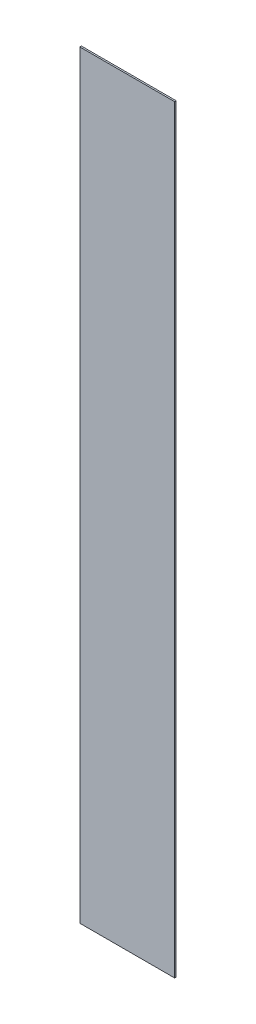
ISO-10303-21;
HEADER;
FILE_DESCRIPTION(('STEP AP214'),'2;1');
FILE_NAME('part.step','',(''),(''),'','','');
FILE_SCHEMA(('AUTOMOTIVE_DESIGN { 1 0 10303 214 1 1 1 1 }'));
ENDSEC;
DATA;
#1=APPLICATION_CONTEXT('core data for automotive mechanical design processes');
#2=APPLICATION_PROTOCOL_DEFINITION('international standard','automotive_design',2000,#1);
#3=PRODUCT_CONTEXT('',#1,'mechanical');
#4=PRODUCT('Part','Part','',(#3));
#5=PRODUCT_RELATED_PRODUCT_CATEGORY('part','',(#4));
#6=PRODUCT_DEFINITION_FORMATION('','',#4);
#7=PRODUCT_DEFINITION_CONTEXT('part definition',#1,'design');
#8=PRODUCT_DEFINITION('design','',#6,#7);
#9=PRODUCT_DEFINITION_SHAPE('','',#8);
#10=(LENGTH_UNIT() NAMED_UNIT(*) SI_UNIT(.MILLI.,.METRE.));
#11=(NAMED_UNIT(*) PLANE_ANGLE_UNIT() SI_UNIT($,.RADIAN.));
#12=(NAMED_UNIT(*) SI_UNIT($,.STERADIAN.) SOLID_ANGLE_UNIT());
#13=UNCERTAINTY_MEASURE_WITH_UNIT(LENGTH_MEASURE(1.E-05),#10,'distance_accuracy_value','');
#14=(GEOMETRIC_REPRESENTATION_CONTEXT(3) GLOBAL_UNCERTAINTY_ASSIGNED_CONTEXT((#13)) GLOBAL_UNIT_ASSIGNED_CONTEXT((#10,
#11,#12)) REPRESENTATION_CONTEXT('',''));
#15=CARTESIAN_POINT('',(0.,0.,0.));
#16=DIRECTION('',(0.,0.,1.));
#17=DIRECTION('',(1.,0.,0.));
#18=AXIS2_PLACEMENT_3D('',#15,#16,#17);
#19=CARTESIAN_POINT('',(-30.,480.,1.00000000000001));
#20=DIRECTION('',(1.,0.,0.));
#21=DIRECTION('',(0.,0.,-1.));
#22=AXIS2_PLACEMENT_3D('',#19,#20,#21);
#23=PLANE('',#22);
#24=DIRECTION('',(0.,0.,1.));
#25=VECTOR('',#24,1.);
#26=CARTESIAN_POINT('',(-30.,0.,1.00000000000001));
#27=LINE('',#26,#25);
#28=CARTESIAN_POINT('',(-30.,0.,0.));
#29=VERTEX_POINT('',#28);
#30=CARTESIAN_POINT('',(-30.,0.,1.00000000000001));
#31=VERTEX_POINT('',#30);
#32=EDGE_CURVE('E95',#29,#31,#27,.T.);
#33=ORIENTED_EDGE('',*,*,#32,.T.);
#34=DIRECTION('',(0.,-1.,0.));
#35=VECTOR('',#34,1.);
#36=CARTESIAN_POINT('',(-30.,480.,1.00000000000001));
#37=LINE('',#36,#35);
#38=CARTESIAN_POINT('',(-30.,480.,1.00000000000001));
#39=VERTEX_POINT('',#38);
#40=EDGE_CURVE('E11',#39,#31,#37,.T.);
#41=ORIENTED_EDGE('',*,*,#40,.F.);
#42=DIRECTION('',(0.,0.,1.));
#43=VECTOR('',#42,1.);
#44=CARTESIAN_POINT('',(-30.,480.,1.00000000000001));
#45=LINE('',#44,#43);
#46=CARTESIAN_POINT('',(-30.,480.,0.));
#47=VERTEX_POINT('',#46);
#48=EDGE_CURVE('E83',#47,#39,#45,.T.);
#49=ORIENTED_EDGE('',*,*,#48,.F.);
#50=DIRECTION('',(0.,-1.,0.));
#51=VECTOR('',#50,1.);
#52=CARTESIAN_POINT('',(-30.,480.,0.));
#53=LINE('',#52,#51);
#54=EDGE_CURVE('E91',#47,#29,#53,.T.);
#55=ORIENTED_EDGE('',*,*,#54,.T.);
#56=EDGE_LOOP('',(#33,#41,#49,#55));
#57=FACE_BOUND('',#56,.T.);
#58=ADVANCED_FACE('F32',(#57),#23,.F.);
#59=CARTESIAN_POINT('',(30.,480.,1.00000000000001));
#60=DIRECTION('',(0.,0.,-1.));
#61=DIRECTION('',(-1.,0.,0.));
#62=AXIS2_PLACEMENT_3D('',#59,#60,#61);
#63=PLANE('',#62);
#64=DIRECTION('',(1.,0.,0.));
#65=VECTOR('',#64,1.);
#66=CARTESIAN_POINT('',(30.,0.,1.00000000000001));
#67=LINE('',#66,#65);
#68=CARTESIAN_POINT('',(30.,0.,1.00000000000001));
#69=VERTEX_POINT('',#68);
#70=EDGE_CURVE('E87',#31,#69,#67,.T.);
#71=ORIENTED_EDGE('',*,*,#70,.T.);
#72=DIRECTION('',(0.,-1.,0.));
#73=VECTOR('',#72,1.);
#74=CARTESIAN_POINT('',(30.,480.,1.00000000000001));
#75=LINE('',#74,#73);
#76=CARTESIAN_POINT('',(30.,480.,1.00000000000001));
#77=VERTEX_POINT('',#76);
#78=EDGE_CURVE('E40',#77,#69,#75,.T.);
#79=ORIENTED_EDGE('',*,*,#78,.F.);
#80=DIRECTION('',(1.,0.,0.));
#81=VECTOR('',#80,1.);
#82=CARTESIAN_POINT('',(30.,480.,1.00000000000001));
#83=LINE('',#82,#81);
#84=EDGE_CURVE('E78',#39,#77,#83,.T.);
#85=ORIENTED_EDGE('',*,*,#84,.F.);
#86=ORIENTED_EDGE('',*,*,#40,.T.);
#87=EDGE_LOOP('',(#71,#79,#85,#86));
#88=FACE_BOUND('',#87,.T.);
#89=ADVANCED_FACE('F86',(#88),#63,.F.);
#90=CARTESIAN_POINT('',(30.,480.,0.));
#91=DIRECTION('',(-1.,0.,0.));
#92=DIRECTION('',(0.,0.,1.));
#93=AXIS2_PLACEMENT_3D('',#90,#91,#92);
#94=PLANE('',#93);
#95=DIRECTION('',(0.,0.,-1.));
#96=VECTOR('',#95,1.);
#97=CARTESIAN_POINT('',(30.,0.,0.));
#98=LINE('',#97,#96);
#99=CARTESIAN_POINT('',(30.,0.,0.));
#100=VERTEX_POINT('',#99);
#101=EDGE_CURVE('E65',#69,#100,#98,.T.);
#102=ORIENTED_EDGE('',*,*,#101,.T.);
#103=DIRECTION('',(0.,-1.,0.));
#104=VECTOR('',#103,1.);
#105=CARTESIAN_POINT('',(30.,480.,0.));
#106=LINE('',#105,#104);
#107=CARTESIAN_POINT('',(30.,480.,0.));
#108=VERTEX_POINT('',#107);
#109=EDGE_CURVE('E88',#108,#100,#106,.T.);
#110=ORIENTED_EDGE('',*,*,#109,.F.);
#111=DIRECTION('',(0.,0.,-1.));
#112=VECTOR('',#111,1.);
#113=CARTESIAN_POINT('',(30.,480.,0.));
#114=LINE('',#113,#112);
#115=EDGE_CURVE('E81',#77,#108,#114,.T.);
#116=ORIENTED_EDGE('',*,*,#115,.F.);
#117=ORIENTED_EDGE('',*,*,#78,.T.);
#118=EDGE_LOOP('',(#102,#110,#116,#117));
#119=FACE_BOUND('',#118,.T.);
#120=ADVANCED_FACE('F89',(#119),#94,.F.);
#121=CARTESIAN_POINT('',(-30.,480.,0.));
#122=DIRECTION('',(0.,0.,1.));
#123=DIRECTION('',(1.,0.,0.));
#124=AXIS2_PLACEMENT_3D('',#121,#122,#123);
#125=PLANE('',#124);
#126=DIRECTION('',(-1.,0.,0.));
#127=VECTOR('',#126,1.);
#128=CARTESIAN_POINT('',(-30.,0.,0.));
#129=LINE('',#128,#127);
#130=EDGE_CURVE('E71',#100,#29,#129,.T.);
#131=ORIENTED_EDGE('',*,*,#130,.T.);
#132=ORIENTED_EDGE('',*,*,#54,.F.);
#133=DIRECTION('',(-1.,0.,0.));
#134=VECTOR('',#133,1.);
#135=CARTESIAN_POINT('',(-30.,480.,0.));
#136=LINE('',#135,#134);
#137=EDGE_CURVE('E48',#108,#47,#136,.T.);
#138=ORIENTED_EDGE('',*,*,#137,.F.);
#139=ORIENTED_EDGE('',*,*,#109,.T.);
#140=EDGE_LOOP('',(#131,#132,#138,#139));
#141=FACE_BOUND('',#140,.T.);
#142=ADVANCED_FACE('F102',(#141),#125,.F.);
#143=CARTESIAN_POINT('',(-30.,480.,0.));
#144=DIRECTION('',(0.,-1.,0.));
#145=DIRECTION('',(0.,0.,-1.));
#146=AXIS2_PLACEMENT_3D('',#143,#144,#145);
#147=PLANE('',#146);
#148=ORIENTED_EDGE('',*,*,#48,.T.);
#149=ORIENTED_EDGE('',*,*,#84,.T.);
#150=ORIENTED_EDGE('',*,*,#115,.T.);
#151=ORIENTED_EDGE('',*,*,#137,.T.);
#152=EDGE_LOOP('',(#148,#149,#150,#151));
#153=FACE_BOUND('',#152,.T.);
#154=ADVANCED_FACE('F79',(#153),#147,.F.);
#155=CARTESIAN_POINT('',(-30.,0.,0.));
#156=DIRECTION('',(0.,-1.,0.));
#157=DIRECTION('',(0.,0.,-1.));
#158=AXIS2_PLACEMENT_3D('',#155,#156,#157);
#159=PLANE('',#158);
#160=ORIENTED_EDGE('',*,*,#32,.F.);
#161=ORIENTED_EDGE('',*,*,#130,.F.);
#162=ORIENTED_EDGE('',*,*,#101,.F.);
#163=ORIENTED_EDGE('',*,*,#70,.F.);
#164=EDGE_LOOP('',(#160,#161,#162,#163));
#165=FACE_BOUND('',#164,.T.);
#166=ADVANCED_FACE('F105',(#165),#159,.T.);
#167=CLOSED_SHELL('',(#58,#89,#120,#142,#154,#166));
#168=MANIFOLD_SOLID_BREP('B2',#167);
#169=ADVANCED_BREP_SHAPE_REPRESENTATION('',(#18,#168),#14);
#170=SHAPE_DEFINITION_REPRESENTATION(#9,#169);
ENDSEC;
END-ISO-10303-21;
